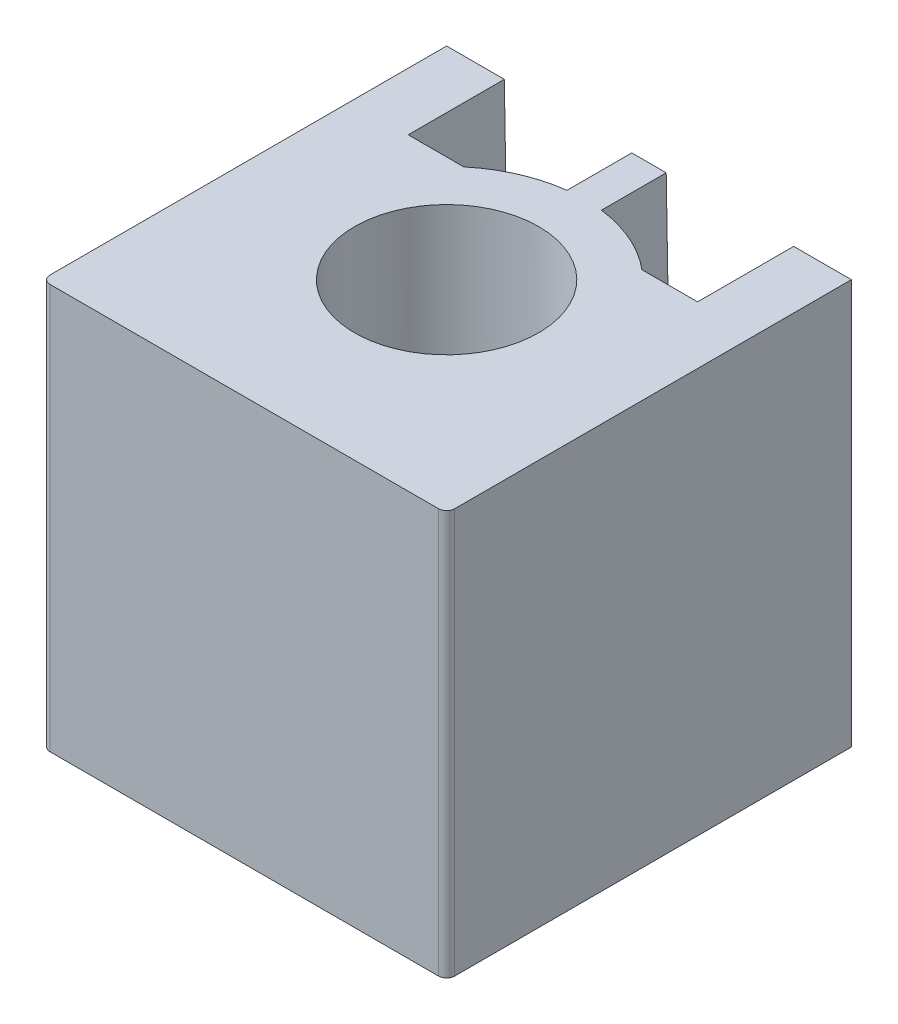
from build123d import *

# Parameters (mm, degrees)
EXTRUSION1_DEPTH                  = 25
ESQUISSE2_R                       = 5.25
ENL_V_MAT_EXTRU_1_DEPTH           = 25
ENL_V_MAT_EXTRU_1_DRAFT           = 1
ENL_V_MAT_EXTRU_1_PROFILE_2_DEPTH = 25
ENL_V_MAT_EXTRU_1_PROFILE_2_DRAFT = 1
ENL_V_MAT_EXTRU_1_PROFILE_3_DEPTH = 25
ENL_V_MAT_EXTRU_1_PROFILE_3_DRAFT = 1


with BuildPart() as part:
    # Esquisse1 → Extrusion1 (new body)
    with BuildSketch(Plane(origin=(0, 0, 0), x_dir=(1, 0, 0), z_dir=(0, 1, 0))):
        with BuildLine():
            Line((0.5, 0), (24.5, 0))
            ThreePointArc((24.5, 0), (24.853553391, 0.146446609), (25, 0.5))
            Line((25, 0.5), (25, 25))
            Line((25, 25), (0, 25))
            Line((0, 25), (0, 0.5))
            ThreePointArc((0, 0.5), (0.146446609, 0.146446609), (0.5, 0))
        make_face()
    extrude(amount=EXTRUSION1_DEPTH)


with BuildPart() as enl_v_mat_extru_1_tool:
    # Esquisse2 → Enl_v. mat.-Extru.1 (with draft: the straight prism first)
    with BuildSketch(Plane.XZ):
        with Locations((12.5, -12.5)):
            Circle(ESQUISSE2_R)
    extrude(amount=-ENL_V_MAT_EXTRU_1_DEPTH)
    # Enl_v. mat.-Extru.1: the draft: its side faces are tilted about the plane it starts from
    enl_v_mat_extru_1_sides = [enl_v_mat_extru_1_tool.faces().sort_by_distance(p)[0] for p in [
        (7.25, 12.5, -12.5),
    ]]
    draft(enl_v_mat_extru_1_sides, Plane.XZ, ENL_V_MAT_EXTRU_1_DRAFT)


with BuildPart() as part_1:
    add(part.part)

    # Enl_v. mat.-Extru.1: cut by enl_v_mat_extru_1_tool
    add(enl_v_mat_extru_1_tool.part, mode=Mode.SUBTRACT)


with BuildPart() as enl_v_mat_extru_1_profile_2_tool:
    # Esquisse2 → Enl_v. mat.-Extru.1 profile 2 (with draft: the straight prism first)
    with BuildSketch(Plane.XZ):
        with BuildLine():
            Line((4, -30.5), (11, -30.5))
            Line((11, -30.5), (11, -21.374119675))
            ThreePointArc((11, -21.374119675), (8.800916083, -20.70468026), (6.843145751, -19.5))
            Line((6.843145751, -19.5), (4, -19.5))
            Line((4, -19.5), (4, -30.5))
        make_face()
    extrude(amount=-ENL_V_MAT_EXTRU_1_PROFILE_2_DEPTH)
    # Enl_v. mat.-Extru.1 profile 2: the draft: its side faces are tilted about the plane it starts from
    enl_v_mat_extru_1_profile_2_sides = [enl_v_mat_extru_1_profile_2_tool.faces().sort_by_distance(p)[0] for p in [
        (7.5, 12.5, -30.5),
        (11, 12.5, -25.937059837),
        (8.800916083, 12.5, -20.70468026),
        (5.421572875, 12.5, -19.5),
        (4, 12.5, -25),
    ]]
    draft(enl_v_mat_extru_1_profile_2_sides, Plane.XZ, ENL_V_MAT_EXTRU_1_PROFILE_2_DRAFT)


with BuildPart() as part_2:
    add(part_1.part)

    # Enl_v. mat.-Extru.1 profile 2: cut by enl_v_mat_extru_1_profile_2_tool
    add(enl_v_mat_extru_1_profile_2_tool.part, mode=Mode.SUBTRACT)


with BuildPart() as enl_v_mat_extru_1_profile_3_tool:
    # Esquisse2 → Enl_v. mat.-Extru.1 profile 3 (with draft: the straight prism first)
    with BuildSketch(Plane.XZ):
        with BuildLine():
            Line((21, -19.5), (18.156854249, -19.5))
            ThreePointArc((18.156854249, -19.5), (16.199083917, -20.70468026), (14, -21.374119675))
            Line((14, -21.374119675), (14, -30.5))
            Line((14, -30.5), (21, -30.5))
            Line((21, -30.5), (21, -19.5))
        make_face()
    extrude(amount=-ENL_V_MAT_EXTRU_1_PROFILE_3_DEPTH)
    # Enl_v. mat.-Extru.1 profile 3: the draft: its side faces are tilted about the plane it starts from
    enl_v_mat_extru_1_profile_3_sides = [enl_v_mat_extru_1_profile_3_tool.faces().sort_by_distance(p)[0] for p in [
        (19.578427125, 12.5, -19.5),
        (16.199083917, 12.5, -20.70468026),
        (14, 12.5, -25.937059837),
        (17.5, 12.5, -30.5),
        (21, 12.5, -25),
    ]]
    draft(enl_v_mat_extru_1_profile_3_sides, Plane.XZ, ENL_V_MAT_EXTRU_1_PROFILE_3_DRAFT)


with BuildPart() as part_3:
    add(part_2.part)

    # Enl_v. mat.-Extru.1 profile 3: cut by enl_v_mat_extru_1_profile_3_tool
    add(enl_v_mat_extru_1_profile_3_tool.part, mode=Mode.SUBTRACT)


solid = part_3.part
